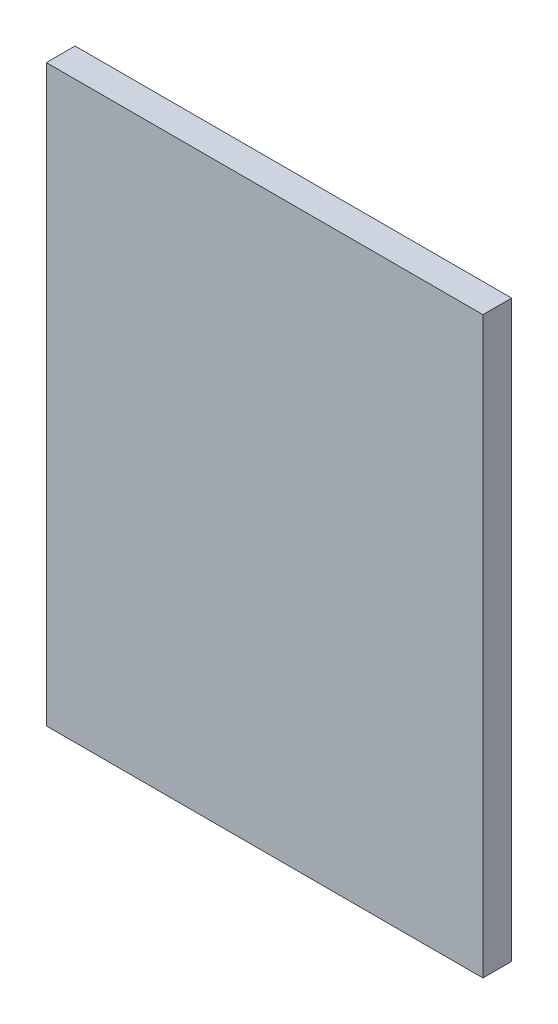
ISO-10303-21;
HEADER;
FILE_DESCRIPTION(('STEP AP214'),'2;1');
FILE_NAME('part.step','',(''),(''),'','','');
FILE_SCHEMA(('AUTOMOTIVE_DESIGN { 1 0 10303 214 1 1 1 1 }'));
ENDSEC;
DATA;
#1=APPLICATION_CONTEXT('core data for automotive mechanical design processes');
#2=APPLICATION_PROTOCOL_DEFINITION('international standard','automotive_design',2000,#1);
#3=PRODUCT_CONTEXT('',#1,'mechanical');
#4=PRODUCT('Part','Part','',(#3));
#5=PRODUCT_RELATED_PRODUCT_CATEGORY('part','',(#4));
#6=PRODUCT_DEFINITION_FORMATION('','',#4);
#7=PRODUCT_DEFINITION_CONTEXT('part definition',#1,'design');
#8=PRODUCT_DEFINITION('design','',#6,#7);
#9=PRODUCT_DEFINITION_SHAPE('','',#8);
#10=(LENGTH_UNIT() NAMED_UNIT(*) SI_UNIT(.MILLI.,.METRE.));
#11=(NAMED_UNIT(*) PLANE_ANGLE_UNIT() SI_UNIT($,.RADIAN.));
#12=(NAMED_UNIT(*) SI_UNIT($,.STERADIAN.) SOLID_ANGLE_UNIT());
#13=UNCERTAINTY_MEASURE_WITH_UNIT(LENGTH_MEASURE(1.E-05),#10,'distance_accuracy_value','');
#14=(GEOMETRIC_REPRESENTATION_CONTEXT(3) GLOBAL_UNCERTAINTY_ASSIGNED_CONTEXT((#13)) GLOBAL_UNIT_ASSIGNED_CONTEXT((#10,
#11,#12)) REPRESENTATION_CONTEXT('',''));
#15=CARTESIAN_POINT('',(0.,0.,0.));
#16=DIRECTION('',(0.,0.,1.));
#17=DIRECTION('',(1.,0.,0.));
#18=AXIS2_PLACEMENT_3D('',#15,#16,#17);
#19=CARTESIAN_POINT('',(0.,0.,0.));
#20=DIRECTION('',(0.,0.,-1.));
#21=DIRECTION('',(-1.,0.,0.));
#22=AXIS2_PLACEMENT_3D('',#19,#20,#21);
#23=PLANE('',#22);
#24=DIRECTION('',(0.,1.,0.));
#25=VECTOR('',#24,1.);
#26=CARTESIAN_POINT('',(48.26,-63.5,0.));
#27=LINE('',#26,#25);
#28=CARTESIAN_POINT('',(48.26,-63.5,0.));
#29=VERTEX_POINT('',#28);
#30=CARTESIAN_POINT('',(48.26,63.5,0.));
#31=VERTEX_POINT('',#30);
#32=EDGE_CURVE('E219',#29,#31,#27,.T.);
#33=ORIENTED_EDGE('',*,*,#32,.F.);
#34=DIRECTION('',(1.,0.,0.));
#35=VECTOR('',#34,1.);
#36=CARTESIAN_POINT('',(-48.26,-63.5,0.));
#37=LINE('',#36,#35);
#38=CARTESIAN_POINT('',(-48.26,-63.5,0.));
#39=VERTEX_POINT('',#38);
#40=EDGE_CURVE('E225',#39,#29,#37,.T.);
#41=ORIENTED_EDGE('',*,*,#40,.F.);
#42=DIRECTION('',(0.,-1.,0.));
#43=VECTOR('',#42,1.);
#44=CARTESIAN_POINT('',(-48.26,-63.5,0.));
#45=LINE('',#44,#43);
#46=CARTESIAN_POINT('',(-48.26,63.5,0.));
#47=VERTEX_POINT('',#46);
#48=EDGE_CURVE('E241',#47,#39,#45,.T.);
#49=ORIENTED_EDGE('',*,*,#48,.F.);
#50=DIRECTION('',(-1.,0.,0.));
#51=VECTOR('',#50,1.);
#52=CARTESIAN_POINT('',(-48.26,63.5,0.));
#53=LINE('',#52,#51);
#54=EDGE_CURVE('E238',#31,#47,#53,.T.);
#55=ORIENTED_EDGE('',*,*,#54,.F.);
#56=EDGE_LOOP('',(#33,#41,#49,#55));
#57=FACE_BOUND('',#56,.T.);
#58=DIRECTION('',(0.,-1.,0.));
#59=VECTOR('',#58,1.);
#60=CARTESIAN_POINT('',(41.91,57.15,0.));
#61=LINE('',#60,#59);
#62=CARTESIAN_POINT('',(41.91,57.15,0.));
#63=VERTEX_POINT('',#62);
#64=CARTESIAN_POINT('',(41.91,-57.15,0.));
#65=VERTEX_POINT('',#64);
#66=EDGE_CURVE('E199',#63,#65,#61,.T.);
#67=ORIENTED_EDGE('',*,*,#66,.F.);
#68=DIRECTION('',(1.,0.,0.));
#69=VECTOR('',#68,1.);
#70=CARTESIAN_POINT('',(-41.91,57.15,0.));
#71=LINE('',#70,#69);
#72=CARTESIAN_POINT('',(-41.91,57.15,0.));
#73=VERTEX_POINT('',#72);
#74=EDGE_CURVE('E149',#73,#63,#71,.T.);
#75=ORIENTED_EDGE('',*,*,#74,.F.);
#76=DIRECTION('',(0.,1.,0.));
#77=VECTOR('',#76,1.);
#78=CARTESIAN_POINT('',(-41.91,-57.15,0.));
#79=LINE('',#78,#77);
#80=CARTESIAN_POINT('',(-41.91,-57.15,0.));
#81=VERTEX_POINT('',#80);
#82=EDGE_CURVE('E186',#81,#73,#79,.T.);
#83=ORIENTED_EDGE('',*,*,#82,.F.);
#84=DIRECTION('',(-1.,0.,0.));
#85=VECTOR('',#84,1.);
#86=CARTESIAN_POINT('',(41.91,-57.15,0.));
#87=LINE('',#86,#85);
#88=EDGE_CURVE('E202',#65,#81,#87,.T.);
#89=ORIENTED_EDGE('',*,*,#88,.F.);
#90=EDGE_LOOP('',(#67,#75,#83,#89));
#91=FACE_BOUND('',#90,.T.);
#92=ADVANCED_FACE('F38',(#57,#91),#23,.T.);
#93=CARTESIAN_POINT('',(48.26,-63.5,6.35));
#94=DIRECTION('',(-1.,0.,0.));
#95=DIRECTION('',(0.,0.,1.));
#96=AXIS2_PLACEMENT_3D('',#93,#94,#95);
#97=PLANE('',#96);
#98=ORIENTED_EDGE('',*,*,#32,.T.);
#99=DIRECTION('',(0.,0.,-1.));
#100=VECTOR('',#99,1.);
#101=CARTESIAN_POINT('',(48.26,63.5,6.35));
#102=LINE('',#101,#100);
#103=CARTESIAN_POINT('',(48.26,63.5,6.35));
#104=VERTEX_POINT('',#103);
#105=EDGE_CURVE('E11',#104,#31,#102,.T.);
#106=ORIENTED_EDGE('',*,*,#105,.F.);
#107=DIRECTION('',(0.,1.,0.));
#108=VECTOR('',#107,1.);
#109=CARTESIAN_POINT('',(48.26,-63.5,6.35));
#110=LINE('',#109,#108);
#111=CARTESIAN_POINT('',(48.26,-63.5,6.35));
#112=VERTEX_POINT('',#111);
#113=EDGE_CURVE('E220',#112,#104,#110,.T.);
#114=ORIENTED_EDGE('',*,*,#113,.F.);
#115=DIRECTION('',(0.,0.,-1.));
#116=VECTOR('',#115,1.);
#117=CARTESIAN_POINT('',(48.26,-63.5,6.35));
#118=LINE('',#117,#116);
#119=EDGE_CURVE('E234',#112,#29,#118,.T.);
#120=ORIENTED_EDGE('',*,*,#119,.T.);
#121=EDGE_LOOP('',(#98,#106,#114,#120));
#122=FACE_BOUND('',#121,.T.);
#123=ADVANCED_FACE('F40',(#122),#97,.F.);
#124=CARTESIAN_POINT('',(-48.26,63.5,6.35));
#125=DIRECTION('',(0.,-1.,0.));
#126=DIRECTION('',(0.,0.,-1.));
#127=AXIS2_PLACEMENT_3D('',#124,#125,#126);
#128=PLANE('',#127);
#129=ORIENTED_EDGE('',*,*,#54,.T.);
#130=DIRECTION('',(0.,0.,-1.));
#131=VECTOR('',#130,1.);
#132=CARTESIAN_POINT('',(-48.26,63.5,6.35));
#133=LINE('',#132,#131);
#134=CARTESIAN_POINT('',(-48.26,63.5,6.35));
#135=VERTEX_POINT('',#134);
#136=EDGE_CURVE('E47',#135,#47,#133,.T.);
#137=ORIENTED_EDGE('',*,*,#136,.F.);
#138=DIRECTION('',(-1.,0.,0.));
#139=VECTOR('',#138,1.);
#140=CARTESIAN_POINT('',(-48.26,63.5,6.35));
#141=LINE('',#140,#139);
#142=EDGE_CURVE('E224',#104,#135,#141,.T.);
#143=ORIENTED_EDGE('',*,*,#142,.F.);
#144=ORIENTED_EDGE('',*,*,#105,.T.);
#145=EDGE_LOOP('',(#129,#137,#143,#144));
#146=FACE_BOUND('',#145,.T.);
#147=ADVANCED_FACE('F274',(#146),#128,.F.);
#148=CARTESIAN_POINT('',(-48.26,-63.5,6.35));
#149=DIRECTION('',(1.,0.,0.));
#150=DIRECTION('',(0.,0.,-1.));
#151=AXIS2_PLACEMENT_3D('',#148,#149,#150);
#152=PLANE('',#151);
#153=ORIENTED_EDGE('',*,*,#48,.T.);
#154=DIRECTION('',(0.,0.,-1.));
#155=VECTOR('',#154,1.);
#156=CARTESIAN_POINT('',(-48.26,-63.5,6.35));
#157=LINE('',#156,#155);
#158=CARTESIAN_POINT('',(-48.26,-63.5,6.35));
#159=VERTEX_POINT('',#158);
#160=EDGE_CURVE('E249',#159,#39,#157,.T.);
#161=ORIENTED_EDGE('',*,*,#160,.F.);
#162=DIRECTION('',(0.,-1.,0.));
#163=VECTOR('',#162,1.);
#164=CARTESIAN_POINT('',(-48.26,-63.5,6.35));
#165=LINE('',#164,#163);
#166=EDGE_CURVE('E228',#135,#159,#165,.T.);
#167=ORIENTED_EDGE('',*,*,#166,.F.);
#168=ORIENTED_EDGE('',*,*,#136,.T.);
#169=EDGE_LOOP('',(#153,#161,#167,#168));
#170=FACE_BOUND('',#169,.T.);
#171=ADVANCED_FACE('F258',(#170),#152,.F.);
#172=CARTESIAN_POINT('',(-48.26,-63.5,6.35));
#173=DIRECTION('',(0.,1.,0.));
#174=DIRECTION('',(0.,0.,1.));
#175=AXIS2_PLACEMENT_3D('',#172,#173,#174);
#176=PLANE('',#175);
#177=ORIENTED_EDGE('',*,*,#40,.T.);
#178=ORIENTED_EDGE('',*,*,#119,.F.);
#179=DIRECTION('',(1.,0.,0.));
#180=VECTOR('',#179,1.);
#181=CARTESIAN_POINT('',(-48.26,-63.5,6.35));
#182=LINE('',#181,#180);
#183=EDGE_CURVE('E231',#159,#112,#182,.T.);
#184=ORIENTED_EDGE('',*,*,#183,.F.);
#185=ORIENTED_EDGE('',*,*,#160,.T.);
#186=EDGE_LOOP('',(#177,#178,#184,#185));
#187=FACE_BOUND('',#186,.T.);
#188=ADVANCED_FACE('F267',(#187),#176,.F.);
#189=CARTESIAN_POINT('',(0.,0.,6.35));
#190=DIRECTION('',(0.,0.,-1.));
#191=DIRECTION('',(-1.,0.,0.));
#192=AXIS2_PLACEMENT_3D('',#189,#190,#191);
#193=PLANE('',#192);
#194=ORIENTED_EDGE('',*,*,#113,.T.);
#195=ORIENTED_EDGE('',*,*,#142,.T.);
#196=ORIENTED_EDGE('',*,*,#166,.T.);
#197=ORIENTED_EDGE('',*,*,#183,.T.);
#198=EDGE_LOOP('',(#194,#195,#196,#197));
#199=FACE_BOUND('',#198,.T.);
#200=ADVANCED_FACE('F273',(#199),#193,.F.);
#201=CARTESIAN_POINT('',(0.,0.,-6.35));
#202=DIRECTION('',(0.,0.,-1.));
#203=DIRECTION('',(-1.,0.,0.));
#204=AXIS2_PLACEMENT_3D('',#201,#202,#203);
#205=PLANE('',#204);
#206=DIRECTION('',(1.,0.,0.));
#207=VECTOR('',#206,1.);
#208=CARTESIAN_POINT('',(-41.91,57.15,-6.35));
#209=LINE('',#208,#207);
#210=CARTESIAN_POINT('',(-41.91,57.15,-6.35));
#211=VERTEX_POINT('',#210);
#212=CARTESIAN_POINT('',(41.91,57.15,-6.35));
#213=VERTEX_POINT('',#212);
#214=EDGE_CURVE('E181',#211,#213,#209,.T.);
#215=ORIENTED_EDGE('',*,*,#214,.T.);
#216=DIRECTION('',(0.,-1.,0.));
#217=VECTOR('',#216,1.);
#218=CARTESIAN_POINT('',(41.91,57.15,-6.35));
#219=LINE('',#218,#217);
#220=CARTESIAN_POINT('',(41.91,-57.15,-6.35));
#221=VERTEX_POINT('',#220);
#222=EDGE_CURVE('E185',#213,#221,#219,.T.);
#223=ORIENTED_EDGE('',*,*,#222,.T.);
#224=DIRECTION('',(-1.,0.,0.));
#225=VECTOR('',#224,1.);
#226=CARTESIAN_POINT('',(41.91,-57.15,-6.35));
#227=LINE('',#226,#225);
#228=CARTESIAN_POINT('',(-41.91,-57.15,-6.35));
#229=VERTEX_POINT('',#228);
#230=EDGE_CURVE('E189',#221,#229,#227,.T.);
#231=ORIENTED_EDGE('',*,*,#230,.T.);
#232=DIRECTION('',(0.,1.,0.));
#233=VECTOR('',#232,1.);
#234=CARTESIAN_POINT('',(-41.91,-57.15,-6.35));
#235=LINE('',#234,#233);
#236=EDGE_CURVE('E192',#229,#211,#235,.T.);
#237=ORIENTED_EDGE('',*,*,#236,.T.);
#238=EDGE_LOOP('',(#215,#223,#231,#237));
#239=FACE_BOUND('',#238,.T.);
#240=DIRECTION('',(0.,-1.,0.));
#241=VECTOR('',#240,1.);
#242=CARTESIAN_POINT('',(39.37,54.61,-6.35));
#243=LINE('',#242,#241);
#244=CARTESIAN_POINT('',(39.37,54.61,-6.35));
#245=VERTEX_POINT('',#244);
#246=CARTESIAN_POINT('',(39.37,-54.61,-6.35));
#247=VERTEX_POINT('',#246);
#248=EDGE_CURVE('E140',#245,#247,#243,.T.);
#249=ORIENTED_EDGE('',*,*,#248,.F.);
#250=DIRECTION('',(1.,0.,0.));
#251=VECTOR('',#250,1.);
#252=CARTESIAN_POINT('',(-39.37,54.61,-6.35));
#253=LINE('',#252,#251);
#254=CARTESIAN_POINT('',(-39.37,54.61,-6.35));
#255=VERTEX_POINT('',#254);
#256=EDGE_CURVE('E130',#255,#245,#253,.T.);
#257=ORIENTED_EDGE('',*,*,#256,.F.);
#258=DIRECTION('',(0.,1.,0.));
#259=VECTOR('',#258,1.);
#260=CARTESIAN_POINT('',(-39.37,-54.61,-6.35));
#261=LINE('',#260,#259);
#262=CARTESIAN_POINT('',(-39.37,-54.61,-6.35));
#263=VERTEX_POINT('',#262);
#264=EDGE_CURVE('E159',#263,#255,#261,.T.);
#265=ORIENTED_EDGE('',*,*,#264,.F.);
#266=DIRECTION('',(-1.,0.,0.));
#267=VECTOR('',#266,1.);
#268=CARTESIAN_POINT('',(39.37,-54.61,-6.35));
#269=LINE('',#268,#267);
#270=EDGE_CURVE('E155',#247,#263,#269,.T.);
#271=ORIENTED_EDGE('',*,*,#270,.F.);
#272=EDGE_LOOP('',(#249,#257,#265,#271));
#273=FACE_BOUND('',#272,.T.);
#274=ADVANCED_FACE('F153',(#239,#273),#205,.T.);
#275=CARTESIAN_POINT('',(-41.91,57.15,-6.35));
#276=DIRECTION('',(0.,-1.,0.));
#277=DIRECTION('',(0.,0.,-1.));
#278=AXIS2_PLACEMENT_3D('',#275,#276,#277);
#279=PLANE('',#278);
#280=ORIENTED_EDGE('',*,*,#74,.T.);
#281=DIRECTION('',(0.,0.,1.));
#282=VECTOR('',#281,1.);
#283=CARTESIAN_POINT('',(41.91,57.15,-6.35));
#284=LINE('',#283,#282);
#285=EDGE_CURVE('E216',#213,#63,#284,.T.);
#286=ORIENTED_EDGE('',*,*,#285,.F.);
#287=ORIENTED_EDGE('',*,*,#214,.F.);
#288=DIRECTION('',(0.,0.,1.));
#289=VECTOR('',#288,1.);
#290=CARTESIAN_POINT('',(-41.91,57.15,-6.35));
#291=LINE('',#290,#289);
#292=EDGE_CURVE('E195',#211,#73,#291,.T.);
#293=ORIENTED_EDGE('',*,*,#292,.T.);
#294=EDGE_LOOP('',(#280,#286,#287,#293));
#295=FACE_BOUND('',#294,.T.);
#296=ADVANCED_FACE('F310',(#295),#279,.F.);
#297=CARTESIAN_POINT('',(41.91,57.15,-6.35));
#298=DIRECTION('',(-1.,0.,0.));
#299=DIRECTION('',(0.,0.,1.));
#300=AXIS2_PLACEMENT_3D('',#297,#298,#299);
#301=PLANE('',#300);
#302=ORIENTED_EDGE('',*,*,#66,.T.);
#303=DIRECTION('',(0.,0.,1.));
#304=VECTOR('',#303,1.);
#305=CARTESIAN_POINT('',(41.91,-57.15,-6.35));
#306=LINE('',#305,#304);
#307=EDGE_CURVE('E212',#221,#65,#306,.T.);
#308=ORIENTED_EDGE('',*,*,#307,.F.);
#309=ORIENTED_EDGE('',*,*,#222,.F.);
#310=ORIENTED_EDGE('',*,*,#285,.T.);
#311=EDGE_LOOP('',(#302,#308,#309,#310));
#312=FACE_BOUND('',#311,.T.);
#313=ADVANCED_FACE('F317',(#312),#301,.F.);
#314=CARTESIAN_POINT('',(41.91,-57.15,-6.35));
#315=DIRECTION('',(0.,1.,0.));
#316=DIRECTION('',(0.,0.,1.));
#317=AXIS2_PLACEMENT_3D('',#314,#315,#316);
#318=PLANE('',#317);
#319=ORIENTED_EDGE('',*,*,#88,.T.);
#320=DIRECTION('',(0.,0.,1.));
#321=VECTOR('',#320,1.);
#322=CARTESIAN_POINT('',(-41.91,-57.15,-6.35));
#323=LINE('',#322,#321);
#324=EDGE_CURVE('E54',#229,#81,#323,.T.);
#325=ORIENTED_EDGE('',*,*,#324,.F.);
#326=ORIENTED_EDGE('',*,*,#230,.F.);
#327=ORIENTED_EDGE('',*,*,#307,.T.);
#328=EDGE_LOOP('',(#319,#325,#326,#327));
#329=FACE_BOUND('',#328,.T.);
#330=ADVANCED_FACE('F314',(#329),#318,.F.);
#331=CARTESIAN_POINT('',(-41.91,-57.15,-6.35));
#332=DIRECTION('',(1.,0.,0.));
#333=DIRECTION('',(0.,0.,-1.));
#334=AXIS2_PLACEMENT_3D('',#331,#332,#333);
#335=PLANE('',#334);
#336=ORIENTED_EDGE('',*,*,#82,.T.);
#337=ORIENTED_EDGE('',*,*,#292,.F.);
#338=ORIENTED_EDGE('',*,*,#236,.F.);
#339=ORIENTED_EDGE('',*,*,#324,.T.);
#340=EDGE_LOOP('',(#336,#337,#338,#339));
#341=FACE_BOUND('',#340,.T.);
#342=ADVANCED_FACE('F307',(#341),#335,.F.);
#343=CARTESIAN_POINT('',(-39.37,54.61,-6.35));
#344=DIRECTION('',(0.,-1.,0.));
#345=DIRECTION('',(1.,0.,0.));
#346=AXIS2_PLACEMENT_3D('',#343,#344,#345);
#347=PLANE('',#346);
#348=DIRECTION('',(1.,0.,0.));
#349=VECTOR('',#348,1.);
#350=CARTESIAN_POINT('',(-39.37,54.61,0.));
#351=LINE('',#350,#349);
#352=CARTESIAN_POINT('',(-39.37,54.61,0.));
#353=VERTEX_POINT('',#352);
#354=CARTESIAN_POINT('',(39.37,54.61,0.));
#355=VERTEX_POINT('',#354);
#356=EDGE_CURVE('E62',#353,#355,#351,.T.);
#357=ORIENTED_EDGE('',*,*,#356,.F.);
#358=DIRECTION('',(0.,0.,1.));
#359=VECTOR('',#358,1.);
#360=CARTESIAN_POINT('',(-39.37,54.61,-6.35));
#361=LINE('',#360,#359);
#362=EDGE_CURVE('E135',#255,#353,#361,.T.);
#363=ORIENTED_EDGE('',*,*,#362,.F.);
#364=ORIENTED_EDGE('',*,*,#256,.T.);
#365=DIRECTION('',(0.,0.,1.));
#366=VECTOR('',#365,1.);
#367=CARTESIAN_POINT('',(39.37,54.61,-6.35));
#368=LINE('',#367,#366);
#369=EDGE_CURVE('E133',#245,#355,#368,.T.);
#370=ORIENTED_EDGE('',*,*,#369,.T.);
#371=EDGE_LOOP('',(#357,#363,#364,#370));
#372=FACE_BOUND('',#371,.T.);
#373=ADVANCED_FACE('F132',(#372),#347,.T.);
#374=CARTESIAN_POINT('',(39.37,54.61,-6.35));
#375=DIRECTION('',(-1.,0.,0.));
#376=DIRECTION('',(0.,-1.,0.));
#377=AXIS2_PLACEMENT_3D('',#374,#375,#376);
#378=PLANE('',#377);
#379=DIRECTION('',(0.,-1.,0.));
#380=VECTOR('',#379,1.);
#381=CARTESIAN_POINT('',(39.37,54.61,0.));
#382=LINE('',#381,#380);
#383=CARTESIAN_POINT('',(39.37,-54.61,0.));
#384=VERTEX_POINT('',#383);
#385=EDGE_CURVE('E147',#355,#384,#382,.T.);
#386=ORIENTED_EDGE('',*,*,#385,.F.);
#387=ORIENTED_EDGE('',*,*,#369,.F.);
#388=ORIENTED_EDGE('',*,*,#248,.T.);
#389=DIRECTION('',(0.,0.,1.));
#390=VECTOR('',#389,1.);
#391=CARTESIAN_POINT('',(39.37,-54.61,-6.35));
#392=LINE('',#391,#390);
#393=EDGE_CURVE('E150',#247,#384,#392,.T.);
#394=ORIENTED_EDGE('',*,*,#393,.T.);
#395=EDGE_LOOP('',(#386,#387,#388,#394));
#396=FACE_BOUND('',#395,.T.);
#397=ADVANCED_FACE('F144',(#396),#378,.T.);
#398=CARTESIAN_POINT('',(39.37,-54.61,-6.35));
#399=DIRECTION('',(0.,1.,0.));
#400=DIRECTION('',(-1.,0.,0.));
#401=AXIS2_PLACEMENT_3D('',#398,#399,#400);
#402=PLANE('',#401);
#403=DIRECTION('',(-1.,0.,0.));
#404=VECTOR('',#403,1.);
#405=CARTESIAN_POINT('',(39.37,-54.61,0.));
#406=LINE('',#405,#404);
#407=CARTESIAN_POINT('',(-39.37,-54.61,0.));
#408=VERTEX_POINT('',#407);
#409=EDGE_CURVE('E168',#384,#408,#406,.T.);
#410=ORIENTED_EDGE('',*,*,#409,.F.);
#411=ORIENTED_EDGE('',*,*,#393,.F.);
#412=ORIENTED_EDGE('',*,*,#270,.T.);
#413=DIRECTION('',(0.,0.,1.));
#414=VECTOR('',#413,1.);
#415=CARTESIAN_POINT('',(-39.37,-54.61,-6.35));
#416=LINE('',#415,#414);
#417=EDGE_CURVE('E175',#263,#408,#416,.T.);
#418=ORIENTED_EDGE('',*,*,#417,.T.);
#419=EDGE_LOOP('',(#410,#411,#412,#418));
#420=FACE_BOUND('',#419,.T.);
#421=ADVANCED_FACE('F293',(#420),#402,.T.);
#422=CARTESIAN_POINT('',(-39.37,-54.61,-6.35));
#423=DIRECTION('',(1.,0.,0.));
#424=DIRECTION('',(0.,0.,-1.));
#425=AXIS2_PLACEMENT_3D('',#422,#423,#424);
#426=PLANE('',#425);
#427=DIRECTION('',(0.,1.,0.));
#428=VECTOR('',#427,1.);
#429=CARTESIAN_POINT('',(-39.37,-54.61,0.));
#430=LINE('',#429,#428);
#431=EDGE_CURVE('E141',#408,#353,#430,.T.);
#432=ORIENTED_EDGE('',*,*,#431,.F.);
#433=ORIENTED_EDGE('',*,*,#417,.F.);
#434=ORIENTED_EDGE('',*,*,#264,.T.);
#435=ORIENTED_EDGE('',*,*,#362,.T.);
#436=EDGE_LOOP('',(#432,#433,#434,#435));
#437=FACE_BOUND('',#436,.T.);
#438=ADVANCED_FACE('F289',(#437),#426,.T.);
#439=ORIENTED_EDGE('',*,*,#356,.T.);
#440=ORIENTED_EDGE('',*,*,#385,.T.);
#441=ORIENTED_EDGE('',*,*,#409,.T.);
#442=ORIENTED_EDGE('',*,*,#431,.T.);
#443=EDGE_LOOP('',(#439,#440,#441,#442));
#444=FACE_BOUND('',#443,.T.);
#445=ADVANCED_FACE('F283',(#444),#23,.T.);
#446=CLOSED_SHELL('',(#92,#123,#147,#171,#188,#200,#274,#296,#313,#330,#342,#373,#397,#421,#438,#445));
#447=MANIFOLD_SOLID_BREP('B2',#446);
#448=ADVANCED_BREP_SHAPE_REPRESENTATION('',(#18,#447),#14);
#449=SHAPE_DEFINITION_REPRESENTATION(#9,#448);
ENDSEC;
END-ISO-10303-21;
